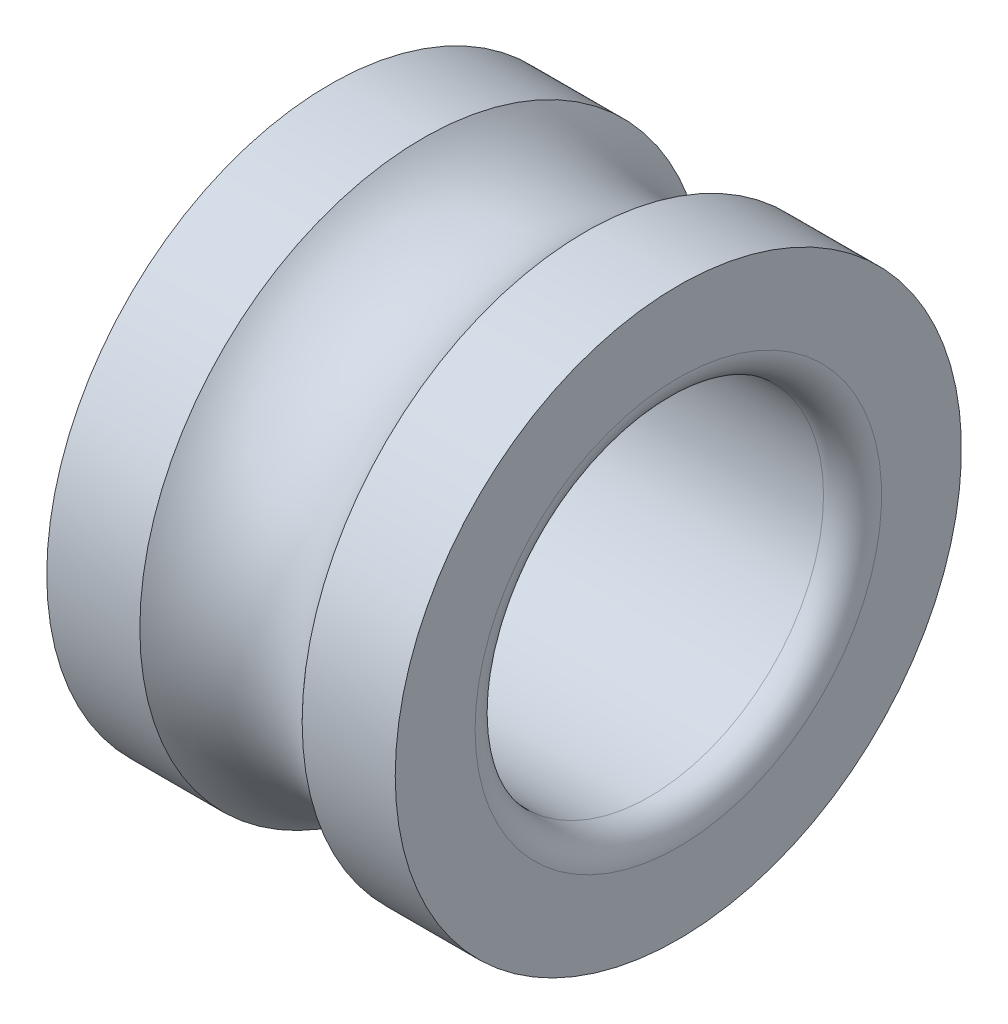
ISO-10303-21;
HEADER;
FILE_DESCRIPTION(('STEP AP214'),'2;1');
FILE_NAME('part.step','',(''),(''),'','','');
FILE_SCHEMA(('AUTOMOTIVE_DESIGN { 1 0 10303 214 1 1 1 1 }'));
ENDSEC;
DATA;
#1=APPLICATION_CONTEXT('core data for automotive mechanical design processes');
#2=APPLICATION_PROTOCOL_DEFINITION('international standard','automotive_design',2000,#1);
#3=PRODUCT_CONTEXT('',#1,'mechanical');
#4=PRODUCT('Part','Part','',(#3));
#5=PRODUCT_RELATED_PRODUCT_CATEGORY('part','',(#4));
#6=PRODUCT_DEFINITION_FORMATION('','',#4);
#7=PRODUCT_DEFINITION_CONTEXT('part definition',#1,'design');
#8=PRODUCT_DEFINITION('design','',#6,#7);
#9=PRODUCT_DEFINITION_SHAPE('','',#8);
#10=(LENGTH_UNIT() NAMED_UNIT(*) SI_UNIT(.MILLI.,.METRE.));
#11=(NAMED_UNIT(*) PLANE_ANGLE_UNIT() SI_UNIT($,.RADIAN.));
#12=(NAMED_UNIT(*) SI_UNIT($,.STERADIAN.) SOLID_ANGLE_UNIT());
#13=UNCERTAINTY_MEASURE_WITH_UNIT(LENGTH_MEASURE(1.E-05),#10,'distance_accuracy_value','');
#14=(GEOMETRIC_REPRESENTATION_CONTEXT(3) GLOBAL_UNCERTAINTY_ASSIGNED_CONTEXT((#13)) GLOBAL_UNIT_ASSIGNED_CONTEXT((#10,
#11,#12)) REPRESENTATION_CONTEXT('',''));
#15=CARTESIAN_POINT('',(0.,0.,0.));
#16=DIRECTION('',(0.,0.,1.));
#17=DIRECTION('',(1.,0.,0.));
#18=AXIS2_PLACEMENT_3D('',#15,#16,#17);
#19=CARTESIAN_POINT('',(1.,0.,0.));
#20=DIRECTION('',(-1.,0.,0.));
#21=DIRECTION('',(0.,0.,1.));
#22=AXIS2_PLACEMENT_3D('',#19,#20,#21);
#23=TOROIDAL_SURFACE('',#22,7.,1.);
#24=CARTESIAN_POINT('',(1.,0.,0.));
#25=DIRECTION('',(-1.,0.,0.));
#26=DIRECTION('',(0.,0.,1.));
#27=AXIS2_PLACEMENT_3D('',#24,#25,#26);
#28=CIRCLE('',#27,6.);
#29=CARTESIAN_POINT('',(1.,0.,6.));
#30=VERTEX_POINT('',#29);
#31=EDGE_CURVE('E10',#30,#30,#28,.T.);
#32=ORIENTED_EDGE('',*,*,#31,.F.);
#33=EDGE_LOOP('',(#32));
#34=FACE_BOUND('',#33,.T.);
#35=CARTESIAN_POINT('',(0.,0.,0.));
#36=DIRECTION('',(-1.,0.,0.));
#37=DIRECTION('',(0.,0.,1.));
#38=AXIS2_PLACEMENT_3D('',#35,#36,#37);
#39=CIRCLE('',#38,7.);
#40=CARTESIAN_POINT('',(0.,0.,7.));
#41=VERTEX_POINT('',#40);
#42=EDGE_CURVE('E55',#41,#41,#39,.T.);
#43=ORIENTED_EDGE('',*,*,#42,.T.);
#44=EDGE_LOOP('',(#43));
#45=FACE_BOUND('',#44,.T.);
#46=ADVANCED_FACE('F27',(#34,#45),#23,.T.);
#47=CARTESIAN_POINT('',(0.,0.,0.));
#48=DIRECTION('',(-1.,0.,0.));
#49=DIRECTION('',(0.,0.,1.));
#50=AXIS2_PLACEMENT_3D('',#47,#48,#49);
#51=CYLINDRICAL_SURFACE('',#50,6.);
#52=CARTESIAN_POINT('',(11.,0.,0.));
#53=DIRECTION('',(-1.,0.,0.));
#54=DIRECTION('',(0.,0.,1.));
#55=AXIS2_PLACEMENT_3D('',#52,#53,#54);
#56=CIRCLE('',#55,6.);
#57=CARTESIAN_POINT('',(11.,0.,6.));
#58=VERTEX_POINT('',#57);
#59=EDGE_CURVE('E33',#58,#58,#56,.T.);
#60=ORIENTED_EDGE('',*,*,#59,.F.);
#61=EDGE_LOOP('',(#60));
#62=FACE_BOUND('',#61,.T.);
#63=ORIENTED_EDGE('',*,*,#31,.T.);
#64=EDGE_LOOP('',(#63));
#65=FACE_BOUND('',#64,.T.);
#66=ADVANCED_FACE('F92',(#62,#65),#51,.F.);
#67=CARTESIAN_POINT('',(11.,0.,0.));
#68=DIRECTION('',(-1.,0.,0.));
#69=DIRECTION('',(0.,0.,1.));
#70=AXIS2_PLACEMENT_3D('',#67,#68,#69);
#71=TOROIDAL_SURFACE('',#70,7.,1.);
#72=CARTESIAN_POINT('',(12.,0.,0.));
#73=DIRECTION('',(-1.,0.,0.));
#74=DIRECTION('',(0.,0.,1.));
#75=AXIS2_PLACEMENT_3D('',#72,#73,#74);
#76=CIRCLE('',#75,7.);
#77=CARTESIAN_POINT('',(12.,0.,7.));
#78=VERTEX_POINT('',#77);
#79=EDGE_CURVE('E37',#78,#78,#76,.T.);
#80=ORIENTED_EDGE('',*,*,#79,.F.);
#81=EDGE_LOOP('',(#80));
#82=FACE_BOUND('',#81,.T.);
#83=ORIENTED_EDGE('',*,*,#59,.T.);
#84=EDGE_LOOP('',(#83));
#85=FACE_BOUND('',#84,.T.);
#86=ADVANCED_FACE('F87',(#82,#85),#71,.T.);
#87=CARTESIAN_POINT('',(12.,0.,-9.75));
#88=DIRECTION('',(-1.,0.,0.));
#89=DIRECTION('',(0.,0.,1.));
#90=AXIS2_PLACEMENT_3D('',#87,#88,#89);
#91=PLANE('',#90);
#92=CARTESIAN_POINT('',(12.,0.,0.));
#93=DIRECTION('',(-1.,0.,0.));
#94=DIRECTION('',(0.,0.,1.));
#95=AXIS2_PLACEMENT_3D('',#92,#93,#94);
#96=CIRCLE('',#95,9.75);
#97=CARTESIAN_POINT('',(12.,0.,9.75));
#98=VERTEX_POINT('',#97);
#99=EDGE_CURVE('E41',#98,#98,#96,.T.);
#100=ORIENTED_EDGE('',*,*,#99,.F.);
#101=EDGE_LOOP('',(#100));
#102=FACE_BOUND('',#101,.T.);
#103=ORIENTED_EDGE('',*,*,#79,.T.);
#104=EDGE_LOOP('',(#103));
#105=FACE_BOUND('',#104,.T.);
#106=ADVANCED_FACE('F81',(#102,#105),#91,.F.);
#107=CARTESIAN_POINT('',(0.,0.,0.));
#108=DIRECTION('',(-1.,0.,0.));
#109=DIRECTION('',(0.,0.,1.));
#110=AXIS2_PLACEMENT_3D('',#107,#108,#109);
#111=CYLINDRICAL_SURFACE('',#110,9.75);
#112=CARTESIAN_POINT('',(8.79508497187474,0.,0.));
#113=DIRECTION('',(-1.,0.,0.));
#114=DIRECTION('',(0.,0.,1.));
#115=AXIS2_PLACEMENT_3D('',#112,#113,#114);
#116=CIRCLE('',#115,9.75);
#117=CARTESIAN_POINT('',(8.79508497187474,0.,9.75));
#118=VERTEX_POINT('',#117);
#119=EDGE_CURVE('E46',#118,#118,#116,.T.);
#120=ORIENTED_EDGE('',*,*,#119,.F.);
#121=EDGE_LOOP('',(#120));
#122=FACE_BOUND('',#121,.T.);
#123=ORIENTED_EDGE('',*,*,#99,.T.);
#124=EDGE_LOOP('',(#123));
#125=FACE_BOUND('',#124,.T.);
#126=ADVANCED_FACE('F75',(#122,#125),#111,.T.);
#127=CARTESIAN_POINT('',(6.00000000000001,0.,0.));
#128=DIRECTION('',(-1.,0.,0.));
#129=DIRECTION('',(0.,0.,1.));
#130=AXIS2_PLACEMENT_3D('',#127,#128,#129);
#131=TOROIDAL_SURFACE('',#130,12.25,3.75);
#132=CARTESIAN_POINT('',(3.20491502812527,0.,0.));
#133=DIRECTION('',(-1.,0.,0.));
#134=DIRECTION('',(0.,0.,1.));
#135=AXIS2_PLACEMENT_3D('',#132,#133,#134);
#136=CIRCLE('',#135,9.75);
#137=CARTESIAN_POINT('',(3.20491502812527,0.,9.75));
#138=VERTEX_POINT('',#137);
#139=EDGE_CURVE('E49',#138,#138,#136,.T.);
#140=ORIENTED_EDGE('',*,*,#139,.F.);
#141=EDGE_LOOP('',(#140));
#142=FACE_BOUND('',#141,.T.);
#143=ORIENTED_EDGE('',*,*,#119,.T.);
#144=EDGE_LOOP('',(#143));
#145=FACE_BOUND('',#144,.T.);
#146=ADVANCED_FACE('F69',(#142,#145),#131,.F.);
#147=CARTESIAN_POINT('',(0.,0.,0.));
#148=DIRECTION('',(-1.,0.,0.));
#149=DIRECTION('',(0.,0.,1.));
#150=AXIS2_PLACEMENT_3D('',#147,#148,#149);
#151=CYLINDRICAL_SURFACE('',#150,9.75);
#152=CARTESIAN_POINT('',(0.,0.,0.));
#153=DIRECTION('',(-1.,0.,0.));
#154=DIRECTION('',(0.,0.,1.));
#155=AXIS2_PLACEMENT_3D('',#152,#153,#154);
#156=CIRCLE('',#155,9.75);
#157=CARTESIAN_POINT('',(0.,0.,9.75));
#158=VERTEX_POINT('',#157);
#159=EDGE_CURVE('E52',#158,#158,#156,.T.);
#160=ORIENTED_EDGE('',*,*,#159,.F.);
#161=EDGE_LOOP('',(#160));
#162=FACE_BOUND('',#161,.T.);
#163=ORIENTED_EDGE('',*,*,#139,.T.);
#164=EDGE_LOOP('',(#163));
#165=FACE_BOUND('',#164,.T.);
#166=ADVANCED_FACE('F63',(#162,#165),#151,.T.);
#167=CARTESIAN_POINT('',(0.,0.,-9.75));
#168=DIRECTION('',(1.,0.,0.));
#169=DIRECTION('',(0.,0.,-1.));
#170=AXIS2_PLACEMENT_3D('',#167,#168,#169);
#171=PLANE('',#170);
#172=ORIENTED_EDGE('',*,*,#42,.F.);
#173=EDGE_LOOP('',(#172));
#174=FACE_BOUND('',#173,.T.);
#175=ORIENTED_EDGE('',*,*,#159,.T.);
#176=EDGE_LOOP('',(#175));
#177=FACE_BOUND('',#176,.T.);
#178=ADVANCED_FACE('F60',(#174,#177),#171,.F.);
#179=CLOSED_SHELL('',(#46,#66,#86,#106,#126,#146,#166,#178));
#180=MANIFOLD_SOLID_BREP('B2',#179);
#181=ADVANCED_BREP_SHAPE_REPRESENTATION('',(#18,#180),#14);
#182=SHAPE_DEFINITION_REPRESENTATION(#9,#181);
ENDSEC;
END-ISO-10303-21;
